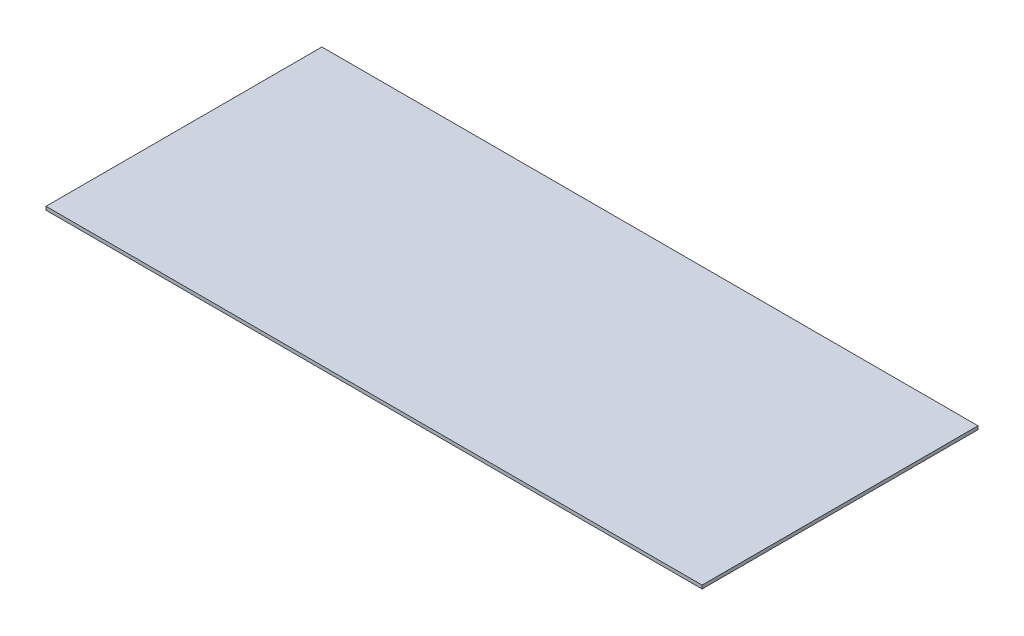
from build123d import *

# Parameters (mm, degrees)
SKETCH1_W      = 2438.4
SKETCH1_H      = 1025.398
EXTRUDE1_DEPTH = 12.7


with BuildPart() as part:
    # Sketch1 → Extrude1 (new body)
    with BuildSketch(Plane(origin=(0, 0, 0), x_dir=(1, 0, 0), z_dir=(0, 1, 0))):
        with Locations((-1219.2, 512.699)):
            Rectangle(SKETCH1_W, SKETCH1_H)
    extrude(amount=EXTRUDE1_DEPTH)


solid = part.part
